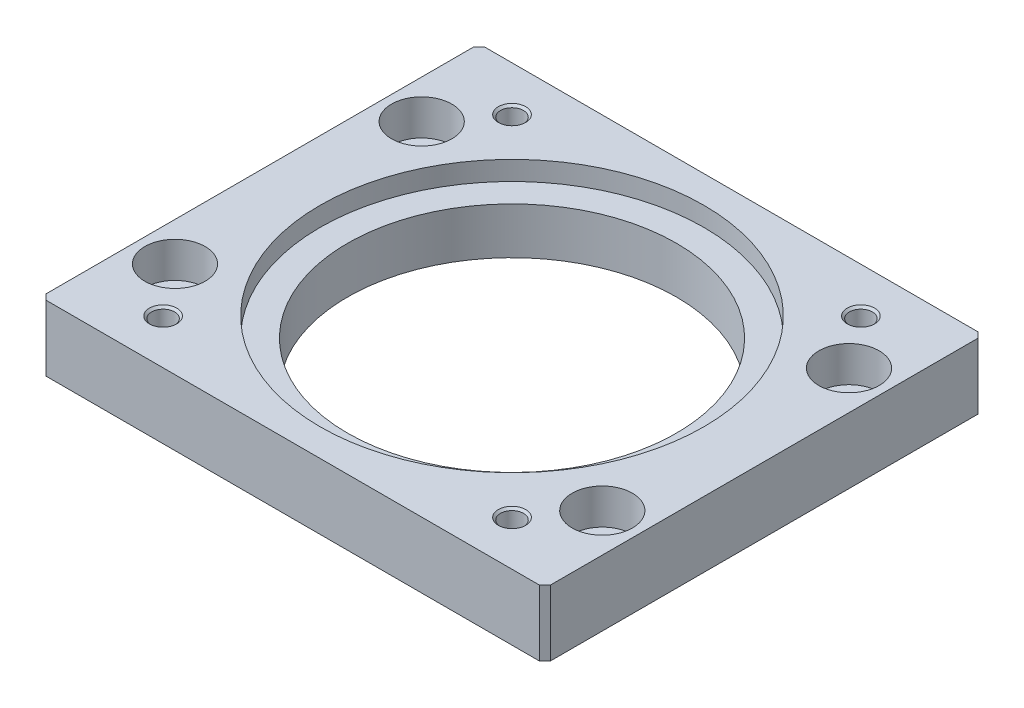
ISO-10303-21;
HEADER;
FILE_DESCRIPTION(('STEP AP214'),'2;1');
FILE_NAME('part.step','',(''),(''),'','','');
FILE_SCHEMA(('AUTOMOTIVE_DESIGN { 1 0 10303 214 1 1 1 1 }'));
ENDSEC;
DATA;
#1=APPLICATION_CONTEXT('core data for automotive mechanical design processes');
#2=APPLICATION_PROTOCOL_DEFINITION('international standard','automotive_design',2000,#1);
#3=PRODUCT_CONTEXT('',#1,'mechanical');
#4=PRODUCT('Part','Part','',(#3));
#5=PRODUCT_RELATED_PRODUCT_CATEGORY('part','',(#4));
#6=PRODUCT_DEFINITION_FORMATION('','',#4);
#7=PRODUCT_DEFINITION_CONTEXT('part definition',#1,'design');
#8=PRODUCT_DEFINITION('design','',#6,#7);
#9=PRODUCT_DEFINITION_SHAPE('','',#8);
#10=(LENGTH_UNIT() NAMED_UNIT(*) SI_UNIT(.MILLI.,.METRE.));
#11=(NAMED_UNIT(*) PLANE_ANGLE_UNIT() SI_UNIT($,.RADIAN.));
#12=(NAMED_UNIT(*) SI_UNIT($,.STERADIAN.) SOLID_ANGLE_UNIT());
#13=UNCERTAINTY_MEASURE_WITH_UNIT(LENGTH_MEASURE(1.E-05),#10,'distance_accuracy_value','');
#14=(GEOMETRIC_REPRESENTATION_CONTEXT(3) GLOBAL_UNCERTAINTY_ASSIGNED_CONTEXT((#13)) GLOBAL_UNIT_ASSIGNED_CONTEXT((#10,
#11,#12)) REPRESENTATION_CONTEXT('',''));
#15=CARTESIAN_POINT('',(0.,0.,0.));
#16=DIRECTION('',(0.,0.,1.));
#17=DIRECTION('',(1.,0.,0.));
#18=AXIS2_PLACEMENT_3D('',#15,#16,#17);
#19=CARTESIAN_POINT('',(-31.81980515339,11.6,31.81980515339));
#20=DIRECTION('',(0.,1.,0.));
#21=DIRECTION('',(0.,0.,1.));
#22=AXIS2_PLACEMENT_3D('',#19,#20,#21);
#23=CONICAL_SURFACE('',#22,2.1,0.785398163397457);
#24=CARTESIAN_POINT('',(-31.81980515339,11.6,31.81980515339));
#25=DIRECTION('',(0.,1.,0.));
#26=DIRECTION('',(1.,0.,0.));
#27=AXIS2_PLACEMENT_3D('',#24,#25,#26);
#28=CIRCLE('',#27,2.1);
#29=CARTESIAN_POINT('',(-29.71980515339,11.6,31.81980515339));
#30=VERTEX_POINT('',#29);
#31=EDGE_CURVE('E169',#30,#30,#28,.F.);
#32=ORIENTED_EDGE('',*,*,#31,.T.);
#33=EDGE_LOOP('',(#32));
#34=FACE_BOUND('',#33,.T.);
#35=CARTESIAN_POINT('',(-31.81980515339,12.,31.81980515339));
#36=DIRECTION('',(0.,1.,0.));
#37=DIRECTION('',(0.,0.,1.));
#38=AXIS2_PLACEMENT_3D('',#35,#36,#37);
#39=CIRCLE('',#38,2.5);
#40=CARTESIAN_POINT('',(-31.81980515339,12.,34.31980515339));
#41=VERTEX_POINT('',#40);
#42=EDGE_CURVE('E188',#41,#41,#39,.T.);
#43=ORIENTED_EDGE('',*,*,#42,.T.);
#44=EDGE_LOOP('',(#43));
#45=FACE_BOUND('',#44,.T.);
#46=ADVANCED_FACE('F16',(#34,#45),#23,.F.);
#47=CARTESIAN_POINT('',(31.81980515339,11.6,31.81980515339));
#48=DIRECTION('',(0.,1.,0.));
#49=DIRECTION('',(0.,0.,1.));
#50=AXIS2_PLACEMENT_3D('',#47,#48,#49);
#51=CONICAL_SURFACE('',#50,2.1,0.785398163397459);
#52=CARTESIAN_POINT('',(31.81980515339,11.6,31.81980515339));
#53=DIRECTION('',(0.,1.,0.));
#54=DIRECTION('',(1.,0.,0.));
#55=AXIS2_PLACEMENT_3D('',#52,#53,#54);
#56=CIRCLE('',#55,2.09999999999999);
#57=CARTESIAN_POINT('',(33.91980515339,11.6,31.81980515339));
#58=VERTEX_POINT('',#57);
#59=EDGE_CURVE('E241',#58,#58,#56,.F.);
#60=ORIENTED_EDGE('',*,*,#59,.T.);
#61=EDGE_LOOP('',(#60));
#62=FACE_BOUND('',#61,.T.);
#63=CARTESIAN_POINT('',(31.81980515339,12.,31.81980515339));
#64=DIRECTION('',(0.,1.,0.));
#65=DIRECTION('',(0.,0.,1.));
#66=AXIS2_PLACEMENT_3D('',#63,#64,#65);
#67=CIRCLE('',#66,2.50000000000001);
#68=CARTESIAN_POINT('',(31.81980515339,12.,34.31980515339));
#69=VERTEX_POINT('',#68);
#70=EDGE_CURVE('E185',#69,#69,#67,.T.);
#71=ORIENTED_EDGE('',*,*,#70,.T.);
#72=EDGE_LOOP('',(#71));
#73=FACE_BOUND('',#72,.T.);
#74=ADVANCED_FACE('F342',(#62,#73),#51,.F.);
#75=CARTESIAN_POINT('',(31.81980515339,11.599999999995,-31.81980515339));
#76=DIRECTION('',(0.,1.,0.));
#77=DIRECTION('',(0.,0.,1.));
#78=AXIS2_PLACEMENT_3D('',#75,#76,#77);
#79=CONICAL_SURFACE('',#78,2.10000000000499,0.785398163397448);
#80=CARTESIAN_POINT('',(31.81980515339,11.6,-31.81980515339));
#81=DIRECTION('',(0.,1.,0.));
#82=DIRECTION('',(1.,0.,0.));
#83=AXIS2_PLACEMENT_3D('',#80,#81,#82);
#84=CIRCLE('',#83,2.09999999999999);
#85=CARTESIAN_POINT('',(33.91980515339,11.6,-31.81980515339));
#86=VERTEX_POINT('',#85);
#87=EDGE_CURVE('E238',#86,#86,#84,.F.);
#88=ORIENTED_EDGE('',*,*,#87,.T.);
#89=EDGE_LOOP('',(#88));
#90=FACE_BOUND('',#89,.T.);
#91=CARTESIAN_POINT('',(31.81980515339,11.999999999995,-31.81980515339));
#92=DIRECTION('',(0.,1.,0.));
#93=DIRECTION('',(-1.,0.,0.));
#94=AXIS2_PLACEMENT_3D('',#91,#92,#93);
#95=CIRCLE('',#94,2.500000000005);
#96=CARTESIAN_POINT('',(29.319805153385,11.999999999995,-31.81980515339));
#97=VERTEX_POINT('',#96);
#98=EDGE_CURVE('E191',#97,#97,#95,.T.);
#99=ORIENTED_EDGE('',*,*,#98,.T.);
#100=EDGE_LOOP('',(#99));
#101=FACE_BOUND('',#100,.T.);
#102=ADVANCED_FACE('F346',(#90,#101),#79,.F.);
#103=CARTESIAN_POINT('',(-31.81980515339,11.599999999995,-31.81980515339));
#104=DIRECTION('',(0.,1.,0.));
#105=DIRECTION('',(-1.,0.,0.));
#106=AXIS2_PLACEMENT_3D('',#103,#104,#105);
#107=CONICAL_SURFACE('',#106,2.100000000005,0.785398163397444);
#108=CARTESIAN_POINT('',(-31.81980515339,11.6,-31.81980515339));
#109=DIRECTION('',(0.,1.,0.));
#110=DIRECTION('',(1.,0.,0.));
#111=AXIS2_PLACEMENT_3D('',#108,#109,#110);
#112=CIRCLE('',#111,2.1);
#113=CARTESIAN_POINT('',(-29.71980515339,11.6,-31.81980515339));
#114=VERTEX_POINT('',#113);
#115=EDGE_CURVE('E165',#114,#114,#112,.F.);
#116=ORIENTED_EDGE('',*,*,#115,.T.);
#117=EDGE_LOOP('',(#116));
#118=FACE_BOUND('',#117,.T.);
#119=CARTESIAN_POINT('',(-31.81980515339,11.999999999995,-31.81980515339));
#120=DIRECTION('',(0.,1.,0.));
#121=DIRECTION('',(0.,0.,1.));
#122=AXIS2_PLACEMENT_3D('',#119,#120,#121);
#123=CIRCLE('',#122,2.500000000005);
#124=CARTESIAN_POINT('',(-31.81980515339,11.999999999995,-29.319805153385));
#125=VERTEX_POINT('',#124);
#126=EDGE_CURVE('E166',#125,#125,#123,.T.);
#127=ORIENTED_EDGE('',*,*,#126,.T.);
#128=EDGE_LOOP('',(#127));
#129=FACE_BOUND('',#128,.T.);
#130=ADVANCED_FACE('F350',(#118,#129),#107,.F.);
#131=CARTESIAN_POINT('',(38.9711431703,5.5,-22.5));
#132=DIRECTION('',(0.,1.,0.));
#133=DIRECTION('',(0.,0.,1.));
#134=AXIS2_PLACEMENT_3D('',#131,#132,#133);
#135=CYLINDRICAL_SURFACE('',#134,5.49999999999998);
#136=CARTESIAN_POINT('',(38.9711431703,5.5,-22.5));
#137=DIRECTION('',(0.,1.,0.));
#138=DIRECTION('',(0.,0.,1.));
#139=AXIS2_PLACEMENT_3D('',#136,#137,#138);
#140=CIRCLE('',#139,5.49999999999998);
#141=CARTESIAN_POINT('',(38.9711431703,5.5,-17.));
#142=VERTEX_POINT('',#141);
#143=EDGE_CURVE('E162',#142,#142,#140,.F.);
#144=ORIENTED_EDGE('',*,*,#143,.T.);
#145=EDGE_LOOP('',(#144));
#146=FACE_BOUND('',#145,.T.);
#147=CARTESIAN_POINT('',(38.9711431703,12.,-22.5));
#148=DIRECTION('',(0.,1.,0.));
#149=DIRECTION('',(0.,0.,1.));
#150=AXIS2_PLACEMENT_3D('',#147,#148,#149);
#151=CIRCLE('',#150,5.49999999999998);
#152=CARTESIAN_POINT('',(38.9711431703,12.,-17.));
#153=VERTEX_POINT('',#152);
#154=EDGE_CURVE('E182',#153,#153,#151,.T.);
#155=ORIENTED_EDGE('',*,*,#154,.T.);
#156=EDGE_LOOP('',(#155));
#157=FACE_BOUND('',#156,.T.);
#158=ADVANCED_FACE('F354',(#146,#157),#135,.F.);
#159=CARTESIAN_POINT('',(38.9711431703,5.5,22.5));
#160=DIRECTION('',(0.,1.,0.));
#161=DIRECTION('',(0.,0.,1.));
#162=AXIS2_PLACEMENT_3D('',#159,#160,#161);
#163=CYLINDRICAL_SURFACE('',#162,5.49999999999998);
#164=CARTESIAN_POINT('',(38.9711431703,5.5,22.5));
#165=DIRECTION('',(0.,1.,0.));
#166=DIRECTION('',(0.,0.,1.));
#167=AXIS2_PLACEMENT_3D('',#164,#165,#166);
#168=CIRCLE('',#167,5.49999999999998);
#169=CARTESIAN_POINT('',(38.9711431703,5.5,28.));
#170=VERTEX_POINT('',#169);
#171=EDGE_CURVE('E159',#170,#170,#168,.F.);
#172=ORIENTED_EDGE('',*,*,#171,.T.);
#173=EDGE_LOOP('',(#172));
#174=FACE_BOUND('',#173,.T.);
#175=CARTESIAN_POINT('',(38.9711431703,12.,22.5));
#176=DIRECTION('',(0.,1.,0.));
#177=DIRECTION('',(0.,0.,1.));
#178=AXIS2_PLACEMENT_3D('',#175,#176,#177);
#179=CIRCLE('',#178,5.49999999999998);
#180=CARTESIAN_POINT('',(38.9711431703,12.,28.));
#181=VERTEX_POINT('',#180);
#182=EDGE_CURVE('E173',#181,#181,#179,.T.);
#183=ORIENTED_EDGE('',*,*,#182,.T.);
#184=EDGE_LOOP('',(#183));
#185=FACE_BOUND('',#184,.T.);
#186=ADVANCED_FACE('F358',(#174,#185),#163,.F.);
#187=CARTESIAN_POINT('',(-38.9711431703,5.5,-22.5));
#188=DIRECTION('',(0.,1.,0.));
#189=DIRECTION('',(0.,0.,1.));
#190=AXIS2_PLACEMENT_3D('',#187,#188,#189);
#191=CYLINDRICAL_SURFACE('',#190,5.5);
#192=CARTESIAN_POINT('',(-38.9711431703,5.5,-22.5));
#193=DIRECTION('',(0.,1.,0.));
#194=DIRECTION('',(0.,0.,1.));
#195=AXIS2_PLACEMENT_3D('',#192,#193,#194);
#196=CIRCLE('',#195,5.5);
#197=CARTESIAN_POINT('',(-38.9711431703,5.5,-17.));
#198=VERTEX_POINT('',#197);
#199=EDGE_CURVE('E156',#198,#198,#196,.F.);
#200=ORIENTED_EDGE('',*,*,#199,.T.);
#201=EDGE_LOOP('',(#200));
#202=FACE_BOUND('',#201,.T.);
#203=CARTESIAN_POINT('',(-38.9711431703,12.,-22.5));
#204=DIRECTION('',(0.,1.,0.));
#205=DIRECTION('',(0.,0.,1.));
#206=AXIS2_PLACEMENT_3D('',#203,#204,#205);
#207=CIRCLE('',#206,5.5);
#208=CARTESIAN_POINT('',(-38.9711431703,12.,-17.));
#209=VERTEX_POINT('',#208);
#210=EDGE_CURVE('E179',#209,#209,#207,.T.);
#211=ORIENTED_EDGE('',*,*,#210,.T.);
#212=EDGE_LOOP('',(#211));
#213=FACE_BOUND('',#212,.T.);
#214=ADVANCED_FACE('F362',(#202,#213),#191,.F.);
#215=CARTESIAN_POINT('',(-38.9711431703,5.5,22.5));
#216=DIRECTION('',(0.,1.,0.));
#217=DIRECTION('',(0.,0.,1.));
#218=AXIS2_PLACEMENT_3D('',#215,#216,#217);
#219=CYLINDRICAL_SURFACE('',#218,5.5);
#220=CARTESIAN_POINT('',(-38.9711431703,5.5,22.5));
#221=DIRECTION('',(0.,1.,0.));
#222=DIRECTION('',(0.,0.,1.));
#223=AXIS2_PLACEMENT_3D('',#220,#221,#222);
#224=CIRCLE('',#223,5.5);
#225=CARTESIAN_POINT('',(-38.9711431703,5.5,28.));
#226=VERTEX_POINT('',#225);
#227=EDGE_CURVE('E104',#226,#226,#224,.F.);
#228=ORIENTED_EDGE('',*,*,#227,.T.);
#229=EDGE_LOOP('',(#228));
#230=FACE_BOUND('',#229,.T.);
#231=CARTESIAN_POINT('',(-38.9711431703,12.,22.5));
#232=DIRECTION('',(0.,1.,0.));
#233=DIRECTION('',(0.,0.,1.));
#234=AXIS2_PLACEMENT_3D('',#231,#232,#233);
#235=CIRCLE('',#234,5.5);
#236=CARTESIAN_POINT('',(-38.9711431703,12.,28.));
#237=VERTEX_POINT('',#236);
#238=EDGE_CURVE('E176',#237,#237,#235,.T.);
#239=ORIENTED_EDGE('',*,*,#238,.T.);
#240=EDGE_LOOP('',(#239));
#241=FACE_BOUND('',#240,.T.);
#242=ADVANCED_FACE('F366',(#230,#241),#219,.F.);
#243=CARTESIAN_POINT('',(0.,8.5,0.));
#244=DIRECTION('',(0.,1.,0.));
#245=DIRECTION('',(0.,0.,1.));
#246=AXIS2_PLACEMENT_3D('',#243,#244,#245);
#247=CYLINDRICAL_SURFACE('',#246,35.);
#248=CARTESIAN_POINT('',(0.,8.5,0.));
#249=DIRECTION('',(0.,1.,0.));
#250=DIRECTION('',(0.,0.,1.));
#251=AXIS2_PLACEMENT_3D('',#248,#249,#250);
#252=CIRCLE('',#251,35.);
#253=CARTESIAN_POINT('',(0.,8.5,35.));
#254=VERTEX_POINT('',#253);
#255=EDGE_CURVE('E101',#254,#254,#252,.F.);
#256=ORIENTED_EDGE('',*,*,#255,.T.);
#257=EDGE_LOOP('',(#256));
#258=FACE_BOUND('',#257,.T.);
#259=CARTESIAN_POINT('',(0.,12.,0.));
#260=DIRECTION('',(0.,1.,0.));
#261=DIRECTION('',(0.,0.,1.));
#262=AXIS2_PLACEMENT_3D('',#259,#260,#261);
#263=CIRCLE('',#262,35.);
#264=CARTESIAN_POINT('',(0.,12.,35.));
#265=VERTEX_POINT('',#264);
#266=EDGE_CURVE('E170',#265,#265,#263,.T.);
#267=ORIENTED_EDGE('',*,*,#266,.T.);
#268=EDGE_LOOP('',(#267));
#269=FACE_BOUND('',#268,.T.);
#270=ADVANCED_FACE('F339',(#258,#269),#247,.F.);
#271=CARTESIAN_POINT('',(-46.11379594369,12.24,-38.88620405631));
#272=DIRECTION('',(-0.707106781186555,0.,-0.70710678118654));
#273=DIRECTION('',(0.70710678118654,0.,-0.707106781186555));
#274=AXIS2_PLACEMENT_3D('',#271,#272,#273);
#275=PLANE('',#274);
#276=DIRECTION('',(0.70710678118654,0.,-0.707106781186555));
#277=VECTOR('',#276,1.);
#278=CARTESIAN_POINT('',(-46.11379594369,12.,-38.88620405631));
#279=LINE('',#278,#277);
#280=CARTESIAN_POINT('',(-46.,12.,-39.));
#281=VERTEX_POINT('',#280);
#282=CARTESIAN_POINT('',(-45.,12.,-40.));
#283=VERTEX_POINT('',#282);
#284=EDGE_CURVE('E194',#281,#283,#279,.T.);
#285=ORIENTED_EDGE('',*,*,#284,.T.);
#286=DIRECTION('',(0.,1.,0.));
#287=VECTOR('',#286,1.);
#288=CARTESIAN_POINT('',(-45.,6.,-40.));
#289=LINE('',#288,#287);
#290=CARTESIAN_POINT('',(-45.,0.,-40.));
#291=VERTEX_POINT('',#290);
#292=EDGE_CURVE('E97',#283,#291,#289,.F.);
#293=ORIENTED_EDGE('',*,*,#292,.T.);
#294=DIRECTION('',(-0.70710678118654,0.,0.707106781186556));
#295=VECTOR('',#294,1.);
#296=CARTESIAN_POINT('',(-45.5,0.,-39.5));
#297=LINE('',#296,#295);
#298=CARTESIAN_POINT('',(-46.,0.,-39.));
#299=VERTEX_POINT('',#298);
#300=EDGE_CURVE('E234',#299,#291,#297,.F.);
#301=ORIENTED_EDGE('',*,*,#300,.F.);
#302=DIRECTION('',(0.,-1.,0.));
#303=VECTOR('',#302,1.);
#304=CARTESIAN_POINT('',(-46.,6.,-39.));
#305=LINE('',#304,#303);
#306=EDGE_CURVE('E247',#299,#281,#305,.F.);
#307=ORIENTED_EDGE('',*,*,#306,.T.);
#308=EDGE_LOOP('',(#285,#293,#301,#307));
#309=FACE_BOUND('',#308,.T.);
#310=ADVANCED_FACE('F250',(#309),#275,.T.);
#311=CARTESIAN_POINT('',(-44.88620405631,12.24,40.11379594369));
#312=DIRECTION('',(-0.707106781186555,0.,0.70710678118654));
#313=DIRECTION('',(-0.70710678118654,0.,-0.707106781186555));
#314=AXIS2_PLACEMENT_3D('',#311,#312,#313);
#315=PLANE('',#314);
#316=DIRECTION('',(-0.70710678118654,0.,-0.707106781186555));
#317=VECTOR('',#316,1.);
#318=CARTESIAN_POINT('',(-44.88620405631,12.,40.11379594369));
#319=LINE('',#318,#317);
#320=CARTESIAN_POINT('',(-45.,12.,40.));
#321=VERTEX_POINT('',#320);
#322=CARTESIAN_POINT('',(-46.,12.,39.));
#323=VERTEX_POINT('',#322);
#324=EDGE_CURVE('E196',#321,#323,#319,.T.);
#325=ORIENTED_EDGE('',*,*,#324,.T.);
#326=DIRECTION('',(0.,1.,0.));
#327=VECTOR('',#326,1.);
#328=CARTESIAN_POINT('',(-46.,6.,39.));
#329=LINE('',#328,#327);
#330=CARTESIAN_POINT('',(-46.,0.,39.));
#331=VERTEX_POINT('',#330);
#332=EDGE_CURVE('E212',#323,#331,#329,.F.);
#333=ORIENTED_EDGE('',*,*,#332,.T.);
#334=DIRECTION('',(0.70710678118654,0.,0.707106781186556));
#335=VECTOR('',#334,1.);
#336=CARTESIAN_POINT('',(-45.5,0.,39.5));
#337=LINE('',#336,#335);
#338=CARTESIAN_POINT('',(-45.,0.,40.));
#339=VERTEX_POINT('',#338);
#340=EDGE_CURVE('E232',#339,#331,#337,.F.);
#341=ORIENTED_EDGE('',*,*,#340,.F.);
#342=DIRECTION('',(0.,-1.,0.));
#343=VECTOR('',#342,1.);
#344=CARTESIAN_POINT('',(-45.,6.,40.));
#345=LINE('',#344,#343);
#346=EDGE_CURVE('E210',#339,#321,#345,.F.);
#347=ORIENTED_EDGE('',*,*,#346,.T.);
#348=EDGE_LOOP('',(#325,#333,#341,#347));
#349=FACE_BOUND('',#348,.T.);
#350=ADVANCED_FACE('F333',(#349),#315,.T.);
#351=CARTESIAN_POINT('',(44.88620405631,12.24,-40.11379594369));
#352=DIRECTION('',(0.707106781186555,0.,-0.70710678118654));
#353=DIRECTION('',(0.70710678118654,0.,0.707106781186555));
#354=AXIS2_PLACEMENT_3D('',#351,#352,#353);
#355=PLANE('',#354);
#356=DIRECTION('',(0.70710678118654,0.,0.707106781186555));
#357=VECTOR('',#356,1.);
#358=CARTESIAN_POINT('',(44.88620405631,12.,-40.11379594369));
#359=LINE('',#358,#357);
#360=CARTESIAN_POINT('',(45.,12.,-40.));
#361=VERTEX_POINT('',#360);
#362=CARTESIAN_POINT('',(46.,12.,-39.));
#363=VERTEX_POINT('',#362);
#364=EDGE_CURVE('E20',#361,#363,#359,.T.);
#365=ORIENTED_EDGE('',*,*,#364,.T.);
#366=DIRECTION('',(0.,1.,0.));
#367=VECTOR('',#366,1.);
#368=CARTESIAN_POINT('',(46.,6.,-39.));
#369=LINE('',#368,#367);
#370=CARTESIAN_POINT('',(46.,0.,-39.));
#371=VERTEX_POINT('',#370);
#372=EDGE_CURVE('E110',#363,#371,#369,.F.);
#373=ORIENTED_EDGE('',*,*,#372,.T.);
#374=DIRECTION('',(-0.70710678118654,0.,-0.707106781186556));
#375=VECTOR('',#374,1.);
#376=CARTESIAN_POINT('',(45.5,0.,-39.5));
#377=LINE('',#376,#375);
#378=CARTESIAN_POINT('',(45.,0.,-40.));
#379=VERTEX_POINT('',#378);
#380=EDGE_CURVE('E100',#379,#371,#377,.F.);
#381=ORIENTED_EDGE('',*,*,#380,.F.);
#382=DIRECTION('',(0.,-1.,0.));
#383=VECTOR('',#382,1.);
#384=CARTESIAN_POINT('',(45.,6.,-40.));
#385=LINE('',#384,#383);
#386=EDGE_CURVE('E94',#379,#361,#385,.F.);
#387=ORIENTED_EDGE('',*,*,#386,.T.);
#388=EDGE_LOOP('',(#365,#373,#381,#387));
#389=FACE_BOUND('',#388,.T.);
#390=ADVANCED_FACE('F99',(#389),#355,.T.);
#391=CARTESIAN_POINT('',(46.11379594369,12.24,38.88620405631));
#392=DIRECTION('',(0.707106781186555,0.,0.70710678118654));
#393=DIRECTION('',(-0.70710678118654,0.,0.707106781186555));
#394=AXIS2_PLACEMENT_3D('',#391,#392,#393);
#395=PLANE('',#394);
#396=DIRECTION('',(-0.70710678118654,0.,0.707106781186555));
#397=VECTOR('',#396,1.);
#398=CARTESIAN_POINT('',(46.11379594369,12.,38.88620405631));
#399=LINE('',#398,#397);
#400=CARTESIAN_POINT('',(46.,12.,39.));
#401=VERTEX_POINT('',#400);
#402=CARTESIAN_POINT('',(45.,12.,40.));
#403=VERTEX_POINT('',#402);
#404=EDGE_CURVE('E88',#401,#403,#399,.T.);
#405=ORIENTED_EDGE('',*,*,#404,.T.);
#406=DIRECTION('',(0.,1.,0.));
#407=VECTOR('',#406,1.);
#408=CARTESIAN_POINT('',(45.,6.,40.));
#409=LINE('',#408,#407);
#410=CARTESIAN_POINT('',(45.,0.,40.));
#411=VERTEX_POINT('',#410);
#412=EDGE_CURVE('E108',#403,#411,#409,.F.);
#413=ORIENTED_EDGE('',*,*,#412,.T.);
#414=DIRECTION('',(0.70710678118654,0.,-0.707106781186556));
#415=VECTOR('',#414,1.);
#416=CARTESIAN_POINT('',(45.5,0.,39.5));
#417=LINE('',#416,#415);
#418=CARTESIAN_POINT('',(46.,0.,39.));
#419=VERTEX_POINT('',#418);
#420=EDGE_CURVE('E35',#419,#411,#417,.F.);
#421=ORIENTED_EDGE('',*,*,#420,.F.);
#422=DIRECTION('',(0.,-1.,0.));
#423=VECTOR('',#422,1.);
#424=CARTESIAN_POINT('',(46.,6.,39.));
#425=LINE('',#424,#423);
#426=EDGE_CURVE('E111',#419,#401,#425,.F.);
#427=ORIENTED_EDGE('',*,*,#426,.T.);
#428=EDGE_LOOP('',(#405,#413,#421,#427));
#429=FACE_BOUND('',#428,.T.);
#430=ADVANCED_FACE('F198',(#429),#395,.T.);
#431=CARTESIAN_POINT('',(-47.84,12.,41.6));
#432=DIRECTION('',(0.,1.,0.));
#433=DIRECTION('',(1.,0.,0.));
#434=AXIS2_PLACEMENT_3D('',#431,#432,#433);
#435=PLANE('',#434);
#436=ORIENTED_EDGE('',*,*,#126,.F.);
#437=EDGE_LOOP('',(#436));
#438=FACE_BOUND('',#437,.T.);
#439=ORIENTED_EDGE('',*,*,#266,.F.);
#440=EDGE_LOOP('',(#439));
#441=FACE_BOUND('',#440,.T.);
#442=ORIENTED_EDGE('',*,*,#182,.F.);
#443=EDGE_LOOP('',(#442));
#444=FACE_BOUND('',#443,.T.);
#445=ORIENTED_EDGE('',*,*,#238,.F.);
#446=EDGE_LOOP('',(#445));
#447=FACE_BOUND('',#446,.T.);
#448=ORIENTED_EDGE('',*,*,#210,.F.);
#449=EDGE_LOOP('',(#448));
#450=FACE_BOUND('',#449,.T.);
#451=ORIENTED_EDGE('',*,*,#154,.F.);
#452=EDGE_LOOP('',(#451));
#453=FACE_BOUND('',#452,.T.);
#454=ORIENTED_EDGE('',*,*,#70,.F.);
#455=EDGE_LOOP('',(#454));
#456=FACE_BOUND('',#455,.T.);
#457=ORIENTED_EDGE('',*,*,#42,.F.);
#458=EDGE_LOOP('',(#457));
#459=FACE_BOUND('',#458,.T.);
#460=ORIENTED_EDGE('',*,*,#98,.F.);
#461=EDGE_LOOP('',(#460));
#462=FACE_BOUND('',#461,.T.);
#463=ORIENTED_EDGE('',*,*,#284,.F.);
#464=DIRECTION('',(0.,0.,-1.));
#465=VECTOR('',#464,1.);
#466=CARTESIAN_POINT('',(-46.,12.,0.));
#467=LINE('',#466,#465);
#468=EDGE_CURVE('E218',#281,#323,#467,.F.);
#469=ORIENTED_EDGE('',*,*,#468,.T.);
#470=ORIENTED_EDGE('',*,*,#324,.F.);
#471=DIRECTION('',(-1.,0.,0.));
#472=VECTOR('',#471,1.);
#473=CARTESIAN_POINT('',(0.,12.,40.));
#474=LINE('',#473,#472);
#475=EDGE_CURVE('E205',#321,#403,#474,.F.);
#476=ORIENTED_EDGE('',*,*,#475,.T.);
#477=ORIENTED_EDGE('',*,*,#404,.F.);
#478=DIRECTION('',(0.,0.,1.));
#479=VECTOR('',#478,1.);
#480=CARTESIAN_POINT('',(46.,12.,0.));
#481=LINE('',#480,#479);
#482=EDGE_CURVE('E84',#401,#363,#481,.F.);
#483=ORIENTED_EDGE('',*,*,#482,.T.);
#484=ORIENTED_EDGE('',*,*,#364,.F.);
#485=DIRECTION('',(1.,0.,0.));
#486=VECTOR('',#485,1.);
#487=CARTESIAN_POINT('',(0.,12.,-40.));
#488=LINE('',#487,#486);
#489=EDGE_CURVE('E82',#361,#283,#488,.F.);
#490=ORIENTED_EDGE('',*,*,#489,.T.);
#491=EDGE_LOOP('',(#463,#469,#470,#476,#477,#483,#484,#490));
#492=FACE_BOUND('',#491,.T.);
#493=ADVANCED_FACE('F81',(#438,#441,#444,#447,#450,#453,#456,#459,#462,#492),#435,.T.);
#494=CARTESIAN_POINT('',(-31.81980515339,0.399999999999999,31.81980515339));
#495=DIRECTION('',(0.,1.,0.));
#496=DIRECTION('',(0.,0.,1.));
#497=AXIS2_PLACEMENT_3D('',#494,#495,#496);
#498=CYLINDRICAL_SURFACE('',#497,2.1);
#499=CARTESIAN_POINT('',(-31.81980515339,0.399999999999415,31.81980515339));
#500=DIRECTION('',(0.,-1.,0.));
#501=DIRECTION('',(0.,0.,-1.));
#502=AXIS2_PLACEMENT_3D('',#499,#500,#501);
#503=CIRCLE('',#502,2.09999999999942);
#504=CARTESIAN_POINT('',(-31.81980515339,0.399999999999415,29.7198051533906));
#505=VERTEX_POINT('',#504);
#506=EDGE_CURVE('E219',#505,#505,#503,.T.);
#507=ORIENTED_EDGE('',*,*,#506,.T.);
#508=EDGE_LOOP('',(#507));
#509=FACE_BOUND('',#508,.T.);
#510=ORIENTED_EDGE('',*,*,#31,.F.);
#511=EDGE_LOOP('',(#510));
#512=FACE_BOUND('',#511,.T.);
#513=ADVANCED_FACE('F327',(#509,#512),#498,.F.);
#514=CARTESIAN_POINT('',(31.81980515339,0.399999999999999,31.81980515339));
#515=DIRECTION('',(0.,1.,0.));
#516=DIRECTION('',(0.,0.,1.));
#517=AXIS2_PLACEMENT_3D('',#514,#515,#516);
#518=CYLINDRICAL_SURFACE('',#517,2.09999999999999);
#519=CARTESIAN_POINT('',(31.81980515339,0.399999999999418,31.81980515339));
#520=DIRECTION('',(0.,-1.,0.));
#521=DIRECTION('',(0.,0.,-1.));
#522=AXIS2_PLACEMENT_3D('',#519,#520,#521);
#523=CIRCLE('',#522,2.09999999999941);
#524=CARTESIAN_POINT('',(31.81980515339,0.399999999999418,29.7198051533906));
#525=VERTEX_POINT('',#524);
#526=EDGE_CURVE('E221',#525,#525,#523,.T.);
#527=ORIENTED_EDGE('',*,*,#526,.T.);
#528=EDGE_LOOP('',(#527));
#529=FACE_BOUND('',#528,.T.);
#530=ORIENTED_EDGE('',*,*,#59,.F.);
#531=EDGE_LOOP('',(#530));
#532=FACE_BOUND('',#531,.T.);
#533=ADVANCED_FACE('F376',(#529,#532),#518,.F.);
#534=CARTESIAN_POINT('',(31.81980515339,0.399999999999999,-31.81980515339));
#535=DIRECTION('',(0.,1.,0.));
#536=DIRECTION('',(0.,0.,1.));
#537=AXIS2_PLACEMENT_3D('',#534,#535,#536);
#538=CYLINDRICAL_SURFACE('',#537,2.09999999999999);
#539=CARTESIAN_POINT('',(31.81980515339,0.400000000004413,-31.81980515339));
#540=DIRECTION('',(0.,-1.,0.));
#541=DIRECTION('',(0.,0.,-1.));
#542=AXIS2_PLACEMENT_3D('',#539,#540,#541);
#543=CIRCLE('',#542,2.10000000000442);
#544=CARTESIAN_POINT('',(31.81980515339,0.400000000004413,-33.9198051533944));
#545=VERTEX_POINT('',#544);
#546=EDGE_CURVE('E226',#545,#545,#543,.T.);
#547=ORIENTED_EDGE('',*,*,#546,.T.);
#548=EDGE_LOOP('',(#547));
#549=FACE_BOUND('',#548,.T.);
#550=ORIENTED_EDGE('',*,*,#87,.F.);
#551=EDGE_LOOP('',(#550));
#552=FACE_BOUND('',#551,.T.);
#553=ADVANCED_FACE('F263',(#549,#552),#538,.F.);
#554=CARTESIAN_POINT('',(-31.81980515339,0.399999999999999,-31.81980515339));
#555=DIRECTION('',(0.,1.,0.));
#556=DIRECTION('',(0.,0.,1.));
#557=AXIS2_PLACEMENT_3D('',#554,#555,#556);
#558=CYLINDRICAL_SURFACE('',#557,2.1);
#559=CARTESIAN_POINT('',(-31.81980515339,0.400000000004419,-31.81980515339));
#560=DIRECTION('',(0.,-1.,0.));
#561=DIRECTION('',(0.,0.,-1.));
#562=AXIS2_PLACEMENT_3D('',#559,#560,#561);
#563=CIRCLE('',#562,2.10000000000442);
#564=CARTESIAN_POINT('',(-31.81980515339,0.400000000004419,-33.9198051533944));
#565=VERTEX_POINT('',#564);
#566=EDGE_CURVE('E152',#565,#565,#563,.T.);
#567=ORIENTED_EDGE('',*,*,#566,.T.);
#568=EDGE_LOOP('',(#567));
#569=FACE_BOUND('',#568,.T.);
#570=ORIENTED_EDGE('',*,*,#115,.F.);
#571=EDGE_LOOP('',(#570));
#572=FACE_BOUND('',#571,.T.);
#573=ADVANCED_FACE('F323',(#569,#572),#558,.F.);
#574=CARTESIAN_POINT('',(-46.24998889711,5.5,29.13192006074));
#575=DIRECTION('',(0.,1.,0.));
#576=DIRECTION('',(1.,0.,0.));
#577=AXIS2_PLACEMENT_3D('',#574,#575,#576);
#578=PLANE('',#577);
#579=CARTESIAN_POINT('',(38.9711431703,5.5,-22.5));
#580=DIRECTION('',(0.,1.,0.));
#581=DIRECTION('',(0.,0.,1.));
#582=AXIS2_PLACEMENT_3D('',#579,#580,#581);
#583=CIRCLE('',#582,3.24999999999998);
#584=CARTESIAN_POINT('',(38.9711431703,5.5,-19.25));
#585=VERTEX_POINT('',#584);
#586=EDGE_CURVE('E150',#585,#585,#583,.F.);
#587=ORIENTED_EDGE('',*,*,#586,.T.);
#588=EDGE_LOOP('',(#587));
#589=FACE_BOUND('',#588,.T.);
#590=ORIENTED_EDGE('',*,*,#143,.F.);
#591=EDGE_LOOP('',(#590));
#592=FACE_BOUND('',#591,.T.);
#593=ADVANCED_FACE('F319',(#589,#592),#578,.T.);
#594=CARTESIAN_POINT('',(-46.24998889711,5.5,29.13192006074));
#595=DIRECTION('',(0.,1.,0.));
#596=DIRECTION('',(1.,0.,0.));
#597=AXIS2_PLACEMENT_3D('',#594,#595,#596);
#598=PLANE('',#597);
#599=CARTESIAN_POINT('',(38.9711431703,5.5,22.5));
#600=DIRECTION('',(0.,1.,0.));
#601=DIRECTION('',(0.,0.,1.));
#602=AXIS2_PLACEMENT_3D('',#599,#600,#601);
#603=CIRCLE('',#602,3.24999999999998);
#604=CARTESIAN_POINT('',(38.9711431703,5.5,25.75));
#605=VERTEX_POINT('',#604);
#606=EDGE_CURVE('E147',#605,#605,#603,.F.);
#607=ORIENTED_EDGE('',*,*,#606,.T.);
#608=EDGE_LOOP('',(#607));
#609=FACE_BOUND('',#608,.T.);
#610=ORIENTED_EDGE('',*,*,#171,.F.);
#611=EDGE_LOOP('',(#610));
#612=FACE_BOUND('',#611,.T.);
#613=ADVANCED_FACE('F315',(#609,#612),#598,.T.);
#614=CARTESIAN_POINT('',(-46.24998889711,5.5,29.13192006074));
#615=DIRECTION('',(0.,1.,0.));
#616=DIRECTION('',(1.,0.,0.));
#617=AXIS2_PLACEMENT_3D('',#614,#615,#616);
#618=PLANE('',#617);
#619=CARTESIAN_POINT('',(-38.9711431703,5.5,-22.5));
#620=DIRECTION('',(0.,1.,0.));
#621=DIRECTION('',(0.,0.,1.));
#622=AXIS2_PLACEMENT_3D('',#619,#620,#621);
#623=CIRCLE('',#622,3.25);
#624=CARTESIAN_POINT('',(-38.9711431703,5.5,-19.25));
#625=VERTEX_POINT('',#624);
#626=EDGE_CURVE('E144',#625,#625,#623,.F.);
#627=ORIENTED_EDGE('',*,*,#626,.T.);
#628=EDGE_LOOP('',(#627));
#629=FACE_BOUND('',#628,.T.);
#630=ORIENTED_EDGE('',*,*,#199,.F.);
#631=EDGE_LOOP('',(#630));
#632=FACE_BOUND('',#631,.T.);
#633=ADVANCED_FACE('F311',(#629,#632),#618,.T.);
#634=CARTESIAN_POINT('',(-46.24998889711,5.5,29.13192006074));
#635=DIRECTION('',(0.,1.,0.));
#636=DIRECTION('',(1.,0.,0.));
#637=AXIS2_PLACEMENT_3D('',#634,#635,#636);
#638=PLANE('',#637);
#639=CARTESIAN_POINT('',(-38.9711431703,5.5,22.5));
#640=DIRECTION('',(0.,1.,0.));
#641=DIRECTION('',(0.,0.,1.));
#642=AXIS2_PLACEMENT_3D('',#639,#640,#641);
#643=CIRCLE('',#642,3.25);
#644=CARTESIAN_POINT('',(-38.9711431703,5.5,25.75));
#645=VERTEX_POINT('',#644);
#646=EDGE_CURVE('E141',#645,#645,#643,.F.);
#647=ORIENTED_EDGE('',*,*,#646,.T.);
#648=EDGE_LOOP('',(#647));
#649=FACE_BOUND('',#648,.T.);
#650=ORIENTED_EDGE('',*,*,#227,.F.);
#651=EDGE_LOOP('',(#650));
#652=FACE_BOUND('',#651,.T.);
#653=ADVANCED_FACE('F307',(#649,#652),#638,.T.);
#654=CARTESIAN_POINT('',(-36.4,8.5,36.42998007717));
#655=DIRECTION('',(0.,1.,0.));
#656=DIRECTION('',(1.,0.,0.));
#657=AXIS2_PLACEMENT_3D('',#654,#655,#656);
#658=PLANE('',#657);
#659=CARTESIAN_POINT('',(0.,8.5,0.));
#660=DIRECTION('',(0.,1.,0.));
#661=DIRECTION('',(0.,0.,1.));
#662=AXIS2_PLACEMENT_3D('',#659,#660,#661);
#663=CIRCLE('',#662,30.);
#664=CARTESIAN_POINT('',(0.,8.5,30.));
#665=VERTEX_POINT('',#664);
#666=EDGE_CURVE('E137',#665,#665,#663,.F.);
#667=ORIENTED_EDGE('',*,*,#666,.T.);
#668=EDGE_LOOP('',(#667));
#669=FACE_BOUND('',#668,.T.);
#670=ORIENTED_EDGE('',*,*,#255,.F.);
#671=EDGE_LOOP('',(#670));
#672=FACE_BOUND('',#671,.T.);
#673=ADVANCED_FACE('F304',(#669,#672),#658,.T.);
#674=CARTESIAN_POINT('',(46.8,-0.24,-40.));
#675=DIRECTION('',(0.,0.,-1.));
#676=DIRECTION('',(-1.,0.,0.));
#677=AXIS2_PLACEMENT_3D('',#674,#675,#676);
#678=PLANE('',#677);
#679=ORIENTED_EDGE('',*,*,#292,.F.);
#680=ORIENTED_EDGE('',*,*,#489,.F.);
#681=ORIENTED_EDGE('',*,*,#386,.F.);
#682=DIRECTION('',(-1.,0.,0.));
#683=VECTOR('',#682,1.);
#684=CARTESIAN_POINT('',(0.,0.,-40.));
#685=LINE('',#684,#683);
#686=EDGE_CURVE('E140',#379,#291,#685,.T.);
#687=ORIENTED_EDGE('',*,*,#686,.T.);
#688=EDGE_LOOP('',(#679,#680,#681,#687));
#689=FACE_BOUND('',#688,.T.);
#690=ADVANCED_FACE('F92',(#689),#678,.T.);
#691=CARTESIAN_POINT('',(-46.,-0.24,-40.56));
#692=DIRECTION('',(-1.,0.,0.));
#693=DIRECTION('',(0.,0.,1.));
#694=AXIS2_PLACEMENT_3D('',#691,#692,#693);
#695=PLANE('',#694);
#696=ORIENTED_EDGE('',*,*,#332,.F.);
#697=ORIENTED_EDGE('',*,*,#468,.F.);
#698=ORIENTED_EDGE('',*,*,#306,.F.);
#699=DIRECTION('',(0.,0.,1.));
#700=VECTOR('',#699,1.);
#701=CARTESIAN_POINT('',(-46.,0.,0.));
#702=LINE('',#701,#700);
#703=EDGE_CURVE('E253',#299,#331,#702,.T.);
#704=ORIENTED_EDGE('',*,*,#703,.T.);
#705=EDGE_LOOP('',(#696,#697,#698,#704));
#706=FACE_BOUND('',#705,.T.);
#707=ADVANCED_FACE('F296',(#706),#695,.T.);
#708=CARTESIAN_POINT('',(-46.8,-0.24,40.));
#709=DIRECTION('',(0.,0.,1.));
#710=DIRECTION('',(1.,0.,0.));
#711=AXIS2_PLACEMENT_3D('',#708,#709,#710);
#712=PLANE('',#711);
#713=ORIENTED_EDGE('',*,*,#412,.F.);
#714=ORIENTED_EDGE('',*,*,#475,.F.);
#715=ORIENTED_EDGE('',*,*,#346,.F.);
#716=DIRECTION('',(1.,0.,0.));
#717=VECTOR('',#716,1.);
#718=CARTESIAN_POINT('',(0.,0.,40.));
#719=LINE('',#718,#717);
#720=EDGE_CURVE('E208',#339,#411,#719,.T.);
#721=ORIENTED_EDGE('',*,*,#720,.T.);
#722=EDGE_LOOP('',(#713,#714,#715,#721));
#723=FACE_BOUND('',#722,.T.);
#724=ADVANCED_FACE('F203',(#723),#712,.T.);
#725=CARTESIAN_POINT('',(46.,-0.24,40.56));
#726=DIRECTION('',(1.,0.,0.));
#727=DIRECTION('',(0.,0.,-1.));
#728=AXIS2_PLACEMENT_3D('',#725,#726,#727);
#729=PLANE('',#728);
#730=ORIENTED_EDGE('',*,*,#426,.F.);
#731=DIRECTION('',(0.,0.,-1.));
#732=VECTOR('',#731,1.);
#733=CARTESIAN_POINT('',(46.,0.,0.));
#734=LINE('',#733,#732);
#735=EDGE_CURVE('E136',#419,#371,#734,.T.);
#736=ORIENTED_EDGE('',*,*,#735,.T.);
#737=ORIENTED_EDGE('',*,*,#372,.F.);
#738=ORIENTED_EDGE('',*,*,#482,.F.);
#739=EDGE_LOOP('',(#730,#736,#737,#738));
#740=FACE_BOUND('',#739,.T.);
#741=ADVANCED_FACE('F286',(#740),#729,.T.);
#742=CARTESIAN_POINT('',(-31.81980515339,0.399999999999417,31.81980515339));
#743=DIRECTION('',(0.,-1.,0.));
#744=DIRECTION('',(0.,0.,-1.));
#745=AXIS2_PLACEMENT_3D('',#742,#743,#744);
#746=CONICAL_SURFACE('',#745,2.09999999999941,0.785398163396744);
#747=ORIENTED_EDGE('',*,*,#506,.F.);
#748=EDGE_LOOP('',(#747));
#749=FACE_BOUND('',#748,.T.);
#750=CARTESIAN_POINT('',(-31.81980515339,-8.67849628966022E-13,31.81980515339));
#751=DIRECTION('',(0.,-1.,0.));
#752=DIRECTION('',(1.,0.,0.));
#753=AXIS2_PLACEMENT_3D('',#750,#751,#752);
#754=CIRCLE('',#753,2.49999999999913);
#755=CARTESIAN_POINT('',(-29.3198051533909,-8.67881896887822E-13,31.81980515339));
#756=VERTEX_POINT('',#755);
#757=EDGE_CURVE('E133',#756,#756,#754,.T.);
#758=ORIENTED_EDGE('',*,*,#757,.T.);
#759=EDGE_LOOP('',(#758));
#760=FACE_BOUND('',#759,.T.);
#761=ADVANCED_FACE('F288',(#749,#760),#746,.F.);
#762=CARTESIAN_POINT('',(31.81980515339,0.39999999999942,31.81980515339));
#763=DIRECTION('',(0.,-1.,0.));
#764=DIRECTION('',(1.,0.,0.));
#765=AXIS2_PLACEMENT_3D('',#762,#763,#764);
#766=CONICAL_SURFACE('',#765,2.09999999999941,0.785398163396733);
#767=ORIENTED_EDGE('',*,*,#526,.F.);
#768=EDGE_LOOP('',(#767));
#769=FACE_BOUND('',#768,.T.);
#770=CARTESIAN_POINT('',(31.81980515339,-8.67795418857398E-13,31.81980515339));
#771=DIRECTION('',(0.,-1.,0.));
#772=DIRECTION('',(0.,0.,-1.));
#773=AXIS2_PLACEMENT_3D('',#770,#771,#772);
#774=CIRCLE('',#773,2.49999999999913);
#775=CARTESIAN_POINT('',(31.81980515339,-8.67795418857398E-13,29.3198051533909));
#776=VERTEX_POINT('',#775);
#777=EDGE_CURVE('E130',#776,#776,#774,.T.);
#778=ORIENTED_EDGE('',*,*,#777,.T.);
#779=EDGE_LOOP('',(#778));
#780=FACE_BOUND('',#779,.T.);
#781=ADVANCED_FACE('F270',(#769,#780),#766,.F.);
#782=CARTESIAN_POINT('',(31.81980515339,0.400000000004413,-31.81980515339));
#783=DIRECTION('',(0.,-1.,0.));
#784=DIRECTION('',(0.,0.,-1.));
#785=AXIS2_PLACEMENT_3D('',#782,#783,#784);
#786=CONICAL_SURFACE('',#785,2.10000000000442,0.785398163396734);
#787=ORIENTED_EDGE('',*,*,#546,.F.);
#788=EDGE_LOOP('',(#787));
#789=FACE_BOUND('',#788,.T.);
#790=CARTESIAN_POINT('',(31.81980515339,4.12869608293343E-12,-31.81980515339));
#791=DIRECTION('',(0.,-1.,0.));
#792=DIRECTION('',(1.,0.,0.));
#793=AXIS2_PLACEMENT_3D('',#790,#791,#792);
#794=CIRCLE('',#793,2.50000000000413);
#795=CARTESIAN_POINT('',(34.3198051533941,4.12866381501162E-12,-31.81980515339));
#796=VERTEX_POINT('',#795);
#797=EDGE_CURVE('E127',#796,#796,#794,.T.);
#798=ORIENTED_EDGE('',*,*,#797,.T.);
#799=EDGE_LOOP('',(#798));
#800=FACE_BOUND('',#799,.T.);
#801=ADVANCED_FACE('F266',(#789,#800),#786,.F.);
#802=CARTESIAN_POINT('',(-31.81980515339,0.400000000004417,-31.81980515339));
#803=DIRECTION('',(0.,-1.,0.));
#804=DIRECTION('',(0.,0.,-1.));
#805=AXIS2_PLACEMENT_3D('',#802,#803,#804);
#806=CONICAL_SURFACE('',#805,2.10000000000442,0.785398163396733);
#807=ORIENTED_EDGE('',*,*,#566,.F.);
#808=EDGE_LOOP('',(#807));
#809=FACE_BOUND('',#808,.T.);
#810=CARTESIAN_POINT('',(-31.81980515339,4.1286418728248E-12,-31.81980515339));
#811=DIRECTION('',(0.,-1.,0.));
#812=DIRECTION('',(0.,0.,-1.));
#813=AXIS2_PLACEMENT_3D('',#810,#811,#812);
#814=CIRCLE('',#813,2.50000000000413);
#815=CARTESIAN_POINT('',(-31.81980515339,4.1286418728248E-12,-34.3198051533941));
#816=VERTEX_POINT('',#815);
#817=EDGE_CURVE('E124',#816,#816,#814,.T.);
#818=ORIENTED_EDGE('',*,*,#817,.T.);
#819=EDGE_LOOP('',(#818));
#820=FACE_BOUND('',#819,.T.);
#821=ADVANCED_FACE('F269',(#809,#820),#806,.F.);
#822=CARTESIAN_POINT('',(38.9711431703,0.,-22.5));
#823=DIRECTION('',(0.,1.,0.));
#824=DIRECTION('',(0.,0.,1.));
#825=AXIS2_PLACEMENT_3D('',#822,#823,#824);
#826=CYLINDRICAL_SURFACE('',#825,3.24999999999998);
#827=CARTESIAN_POINT('',(38.9711431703,0.,-22.5));
#828=DIRECTION('',(0.,1.,0.));
#829=DIRECTION('',(0.,0.,1.));
#830=AXIS2_PLACEMENT_3D('',#827,#828,#829);
#831=CIRCLE('',#830,3.24999999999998);
#832=CARTESIAN_POINT('',(38.9711431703,0.,-19.25));
#833=VERTEX_POINT('',#832);
#834=EDGE_CURVE('E121',#833,#833,#831,.F.);
#835=ORIENTED_EDGE('',*,*,#834,.T.);
#836=EDGE_LOOP('',(#835));
#837=FACE_BOUND('',#836,.T.);
#838=ORIENTED_EDGE('',*,*,#586,.F.);
#839=EDGE_LOOP('',(#838));
#840=FACE_BOUND('',#839,.T.);
#841=ADVANCED_FACE('F390',(#837,#840),#826,.F.);
#842=CARTESIAN_POINT('',(38.9711431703,0.,22.5));
#843=DIRECTION('',(0.,1.,0.));
#844=DIRECTION('',(0.,0.,1.));
#845=AXIS2_PLACEMENT_3D('',#842,#843,#844);
#846=CYLINDRICAL_SURFACE('',#845,3.24999999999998);
#847=CARTESIAN_POINT('',(38.9711431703,0.,22.5));
#848=DIRECTION('',(0.,1.,0.));
#849=DIRECTION('',(0.,0.,1.));
#850=AXIS2_PLACEMENT_3D('',#847,#848,#849);
#851=CIRCLE('',#850,3.24999999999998);
#852=CARTESIAN_POINT('',(38.9711431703,0.,25.75));
#853=VERTEX_POINT('',#852);
#854=EDGE_CURVE('E118',#853,#853,#851,.F.);
#855=ORIENTED_EDGE('',*,*,#854,.T.);
#856=EDGE_LOOP('',(#855));
#857=FACE_BOUND('',#856,.T.);
#858=ORIENTED_EDGE('',*,*,#606,.F.);
#859=EDGE_LOOP('',(#858));
#860=FACE_BOUND('',#859,.T.);
#861=ADVANCED_FACE('F394',(#857,#860),#846,.F.);
#862=CARTESIAN_POINT('',(-38.9711431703,0.,-22.5));
#863=DIRECTION('',(0.,1.,0.));
#864=DIRECTION('',(0.,0.,1.));
#865=AXIS2_PLACEMENT_3D('',#862,#863,#864);
#866=CYLINDRICAL_SURFACE('',#865,3.25);
#867=CARTESIAN_POINT('',(-38.9711431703,0.,-22.5));
#868=DIRECTION('',(0.,1.,0.));
#869=DIRECTION('',(0.,0.,1.));
#870=AXIS2_PLACEMENT_3D('',#867,#868,#869);
#871=CIRCLE('',#870,3.25);
#872=CARTESIAN_POINT('',(-38.9711431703,0.,-19.25));
#873=VERTEX_POINT('',#872);
#874=EDGE_CURVE('E115',#873,#873,#871,.F.);
#875=ORIENTED_EDGE('',*,*,#874,.T.);
#876=EDGE_LOOP('',(#875));
#877=FACE_BOUND('',#876,.T.);
#878=ORIENTED_EDGE('',*,*,#626,.F.);
#879=EDGE_LOOP('',(#878));
#880=FACE_BOUND('',#879,.T.);
#881=ADVANCED_FACE('F398',(#877,#880),#866,.F.);
#882=CARTESIAN_POINT('',(-38.9711431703,0.,22.5));
#883=DIRECTION('',(0.,1.,0.));
#884=DIRECTION('',(0.,0.,1.));
#885=AXIS2_PLACEMENT_3D('',#882,#883,#884);
#886=CYLINDRICAL_SURFACE('',#885,3.25);
#887=CARTESIAN_POINT('',(-38.9711431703,0.,22.5));
#888=DIRECTION('',(0.,1.,0.));
#889=DIRECTION('',(0.,0.,1.));
#890=AXIS2_PLACEMENT_3D('',#887,#888,#889);
#891=CIRCLE('',#890,3.25);
#892=CARTESIAN_POINT('',(-38.9711431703,0.,25.75));
#893=VERTEX_POINT('',#892);
#894=EDGE_CURVE('E26',#893,#893,#891,.F.);
#895=ORIENTED_EDGE('',*,*,#894,.T.);
#896=EDGE_LOOP('',(#895));
#897=FACE_BOUND('',#896,.T.);
#898=ORIENTED_EDGE('',*,*,#646,.F.);
#899=EDGE_LOOP('',(#898));
#900=FACE_BOUND('',#899,.T.);
#901=ADVANCED_FACE('F402',(#897,#900),#886,.F.);
#902=CARTESIAN_POINT('',(0.,0.,0.));
#903=DIRECTION('',(0.,1.,0.));
#904=DIRECTION('',(0.,0.,1.));
#905=AXIS2_PLACEMENT_3D('',#902,#903,#904);
#906=CYLINDRICAL_SURFACE('',#905,30.);
#907=CARTESIAN_POINT('',(0.,0.,0.));
#908=DIRECTION('',(0.,1.,0.));
#909=DIRECTION('',(0.,0.,1.));
#910=AXIS2_PLACEMENT_3D('',#907,#908,#909);
#911=CIRCLE('',#910,30.);
#912=CARTESIAN_POINT('',(0.,0.,30.));
#913=VERTEX_POINT('',#912);
#914=EDGE_CURVE('E10',#913,#913,#911,.F.);
#915=ORIENTED_EDGE('',*,*,#914,.T.);
#916=EDGE_LOOP('',(#915));
#917=FACE_BOUND('',#916,.T.);
#918=ORIENTED_EDGE('',*,*,#666,.F.);
#919=EDGE_LOOP('',(#918));
#920=FACE_BOUND('',#919,.T.);
#921=ADVANCED_FACE('F276',(#917,#920),#906,.F.);
#922=CARTESIAN_POINT('',(-47.84,0.,41.6));
#923=DIRECTION('',(0.,1.,0.));
#924=DIRECTION('',(1.,0.,0.));
#925=AXIS2_PLACEMENT_3D('',#922,#923,#924);
#926=PLANE('',#925);
#927=ORIENTED_EDGE('',*,*,#914,.F.);
#928=EDGE_LOOP('',(#927));
#929=FACE_BOUND('',#928,.T.);
#930=ORIENTED_EDGE('',*,*,#894,.F.);
#931=EDGE_LOOP('',(#930));
#932=FACE_BOUND('',#931,.T.);
#933=ORIENTED_EDGE('',*,*,#874,.F.);
#934=EDGE_LOOP('',(#933));
#935=FACE_BOUND('',#934,.T.);
#936=ORIENTED_EDGE('',*,*,#854,.F.);
#937=EDGE_LOOP('',(#936));
#938=FACE_BOUND('',#937,.T.);
#939=ORIENTED_EDGE('',*,*,#834,.F.);
#940=EDGE_LOOP('',(#939));
#941=FACE_BOUND('',#940,.T.);
#942=ORIENTED_EDGE('',*,*,#817,.F.);
#943=EDGE_LOOP('',(#942));
#944=FACE_BOUND('',#943,.T.);
#945=ORIENTED_EDGE('',*,*,#797,.F.);
#946=EDGE_LOOP('',(#945));
#947=FACE_BOUND('',#946,.T.);
#948=ORIENTED_EDGE('',*,*,#777,.F.);
#949=EDGE_LOOP('',(#948));
#950=FACE_BOUND('',#949,.T.);
#951=ORIENTED_EDGE('',*,*,#757,.F.);
#952=EDGE_LOOP('',(#951));
#953=FACE_BOUND('',#952,.T.);
#954=ORIENTED_EDGE('',*,*,#420,.T.);
#955=ORIENTED_EDGE('',*,*,#720,.F.);
#956=ORIENTED_EDGE('',*,*,#340,.T.);
#957=ORIENTED_EDGE('',*,*,#703,.F.);
#958=ORIENTED_EDGE('',*,*,#300,.T.);
#959=ORIENTED_EDGE('',*,*,#686,.F.);
#960=ORIENTED_EDGE('',*,*,#380,.T.);
#961=ORIENTED_EDGE('',*,*,#735,.F.);
#962=EDGE_LOOP('',(#954,#955,#956,#957,#958,#959,#960,#961));
#963=FACE_BOUND('',#962,.T.);
#964=ADVANCED_FACE('F18',(#929,#932,#935,#938,#941,#944,#947,#950,#953,#963),#926,.F.);
#965=CLOSED_SHELL('',(#46,#74,#102,#130,#158,#186,#214,#242,#270,#310,#350,#390,#430,#493,#513,
#533,#553,#573,#593,#613,#633,#653,#673,#690,#707,#724,#741,#761,#781,#801,#821,#841,#861,#881,
#901,#921,#964));
#966=MANIFOLD_SOLID_BREP('B1',#965);
#967=ADVANCED_BREP_SHAPE_REPRESENTATION('',(#18,#966),#14);
#968=SHAPE_DEFINITION_REPRESENTATION(#9,#967);
ENDSEC;
END-ISO-10303-21;
